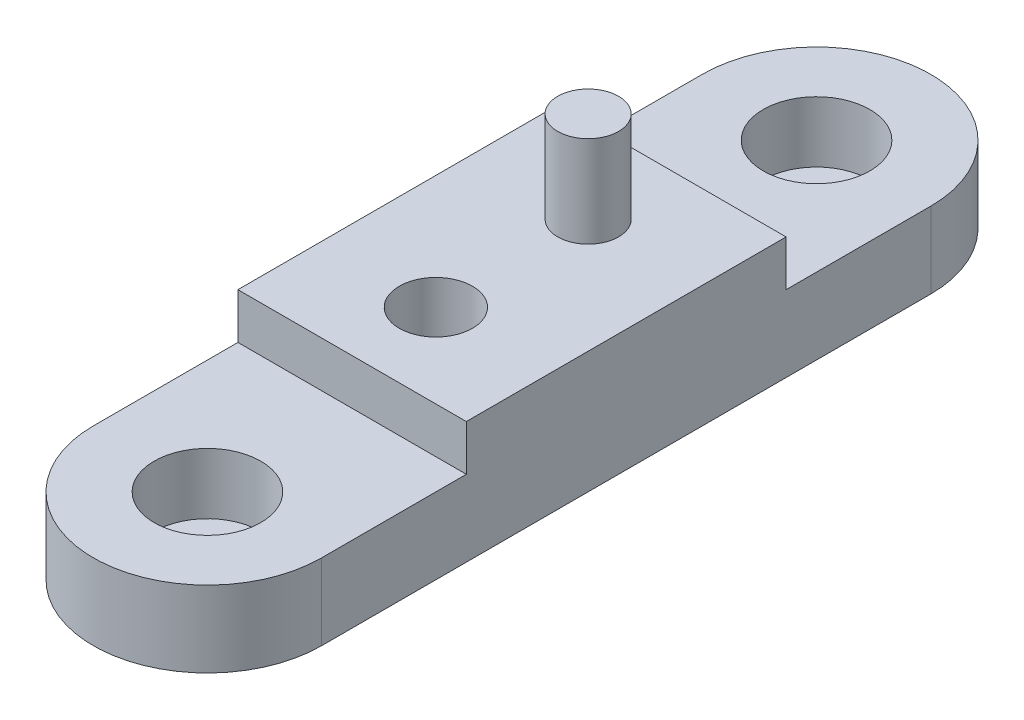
from build123d import *

# Parameters (mm, degrees)
BOSS_EXTRUDE1_DEPTH = 4
CUT_EXTRUDE1_START  = -1.5
CUT_EXTRUDE1_DEPTH  = 1.5
SKETCH3_R           = 1.75
CUT_EXTRUDE2_DEPTH  = 2
SKETCH4_R           = 1
BOSS_EXTRUDE2_DEPTH = 3
SKETCH5_R           = 1.2
CUT_EXTRUDE3_DEPTH  = 4


with BuildPart() as part:
    # Sketch1 → Boss-Extrude1 (new body)
    with BuildSketch(Plane(origin=(0, 0, 0), x_dir=(1, 0, 0), z_dir=(0, 1, 0))):
        with BuildLine():
            Line((-3.75, -10), (3.75, -10))
            Line((3.75, -10), (3.75, 0))
            ThreePointArc((3.75, 0), (0, 3.75), (-3.75, 0))
            Line((-3.75, 0), (-3.75, -10))
        make_face()
    extrude(amount=BOSS_EXTRUDE1_DEPTH)

    # Sketch2 → Cut-Extrude1 (cut)
    with BuildSketch(Plane(origin=(0, 4, 0), x_dir=(1, 0, 0), z_dir=(0, 1, 0)).offset(CUT_EXTRUDE1_START)):
        with BuildLine():
            Line((-3.75, -4.75), (3.75, -4.75))
            Line((3.75, -4.75), (3.75, 0))
            ThreePointArc((3.75, 0), (0, 3.75), (-3.75, 0))
            Line((-3.75, 0), (-3.75, -4.75))
        make_face()
    extrude(amount=CUT_EXTRUDE1_DEPTH, mode=Mode.SUBTRACT)

    # Sketch3 → Cut-Extrude2 (cut)
    with BuildSketch(Plane(origin=(0, 2.5, 0), x_dir=(1, 0, 0), z_dir=(0, 1, 0))):
        with Locations(Location((0, 0, 0), (0, 0, 270))):
            Circle(SKETCH3_R)
    extrude(amount=-CUT_EXTRUDE2_DEPTH, mode=Mode.SUBTRACT)

    # Mirror1: part across plane


with BuildPart() as part_1:
    add(part.part)
    add(part.part.mirror(Plane(origin=(-3.75, 4, 10), x_dir=(1, 0, 0), z_dir=(0, 0, -1))))

    # Sketch4 → Boss-Extrude2 (add)
    with BuildSketch(Plane(origin=(0, 4, 0), x_dir=(1, 0, 0), z_dir=(0, 1, 0))):
        with Locations(Location((0, -7.5, 0), (0, 0, 270))):
            Circle(SKETCH4_R)
    extrude(amount=BOSS_EXTRUDE2_DEPTH)

    # Sketch5 → Cut-Extrude3 (cut)
    with BuildSketch(Plane(origin=(0, 4, 0), x_dir=(1, 0, 0), z_dir=(0, 1, 0))):
        with Locations(Location((0, -12.5, 0), (0, 0, 270))):
            Circle(SKETCH5_R)
    extrude(amount=-CUT_EXTRUDE3_DEPTH, mode=Mode.SUBTRACT)


solid = part_1.part
